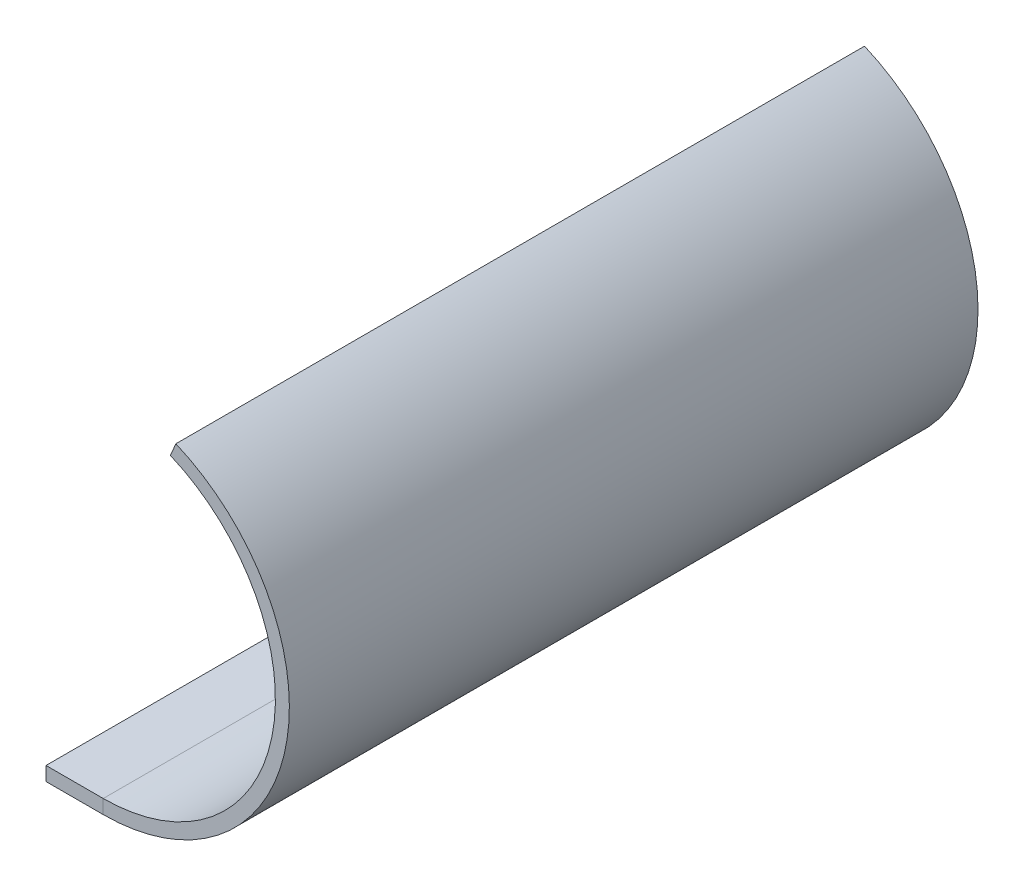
ISO-10303-21;
HEADER;
FILE_DESCRIPTION(('STEP AP214'),'2;1');
FILE_NAME('part.step','',(''),(''),'','','');
FILE_SCHEMA(('AUTOMOTIVE_DESIGN { 1 0 10303 214 1 1 1 1 }'));
ENDSEC;
DATA;
#1=APPLICATION_CONTEXT('core data for automotive mechanical design processes');
#2=APPLICATION_PROTOCOL_DEFINITION('international standard','automotive_design',2000,#1);
#3=PRODUCT_CONTEXT('',#1,'mechanical');
#4=PRODUCT('Part','Part','',(#3));
#5=PRODUCT_RELATED_PRODUCT_CATEGORY('part','',(#4));
#6=PRODUCT_DEFINITION_FORMATION('','',#4);
#7=PRODUCT_DEFINITION_CONTEXT('part definition',#1,'design');
#8=PRODUCT_DEFINITION('design','',#6,#7);
#9=PRODUCT_DEFINITION_SHAPE('','',#8);
#10=(LENGTH_UNIT() NAMED_UNIT(*) SI_UNIT(.MILLI.,.METRE.));
#11=(NAMED_UNIT(*) PLANE_ANGLE_UNIT() SI_UNIT($,.RADIAN.));
#12=(NAMED_UNIT(*) SI_UNIT($,.STERADIAN.) SOLID_ANGLE_UNIT());
#13=UNCERTAINTY_MEASURE_WITH_UNIT(LENGTH_MEASURE(1.E-05),#10,'distance_accuracy_value','');
#14=(GEOMETRIC_REPRESENTATION_CONTEXT(3) GLOBAL_UNCERTAINTY_ASSIGNED_CONTEXT((#13)) GLOBAL_UNIT_ASSIGNED_CONTEXT((#10,
#11,#12)) REPRESENTATION_CONTEXT('',''));
#15=CARTESIAN_POINT('',(0.,0.,0.));
#16=DIRECTION('',(0.,0.,1.));
#17=DIRECTION('',(1.,0.,0.));
#18=AXIS2_PLACEMENT_3D('',#15,#16,#17);
#19=CARTESIAN_POINT('',(0.,-40.,148.));
#20=DIRECTION('',(0.,0.,1.));
#21=DIRECTION('',(1.,0.,0.));
#22=AXIS2_PLACEMENT_3D('',#19,#20,#21);
#23=PLANE('',#22);
#24=DIRECTION('',(0.,1.,0.));
#25=VECTOR('',#24,1.);
#26=CARTESIAN_POINT('',(0.,-40.,148.));
#27=LINE('',#26,#25);
#28=CARTESIAN_POINT('',(0.,-40.,148.));
#29=VERTEX_POINT('',#28);
#30=CARTESIAN_POINT('',(0.,-37.,148.));
#31=VERTEX_POINT('',#30);
#32=EDGE_CURVE('E11',#29,#31,#27,.T.);
#33=ORIENTED_EDGE('',*,*,#32,.F.);
#34=CARTESIAN_POINT('',(0.,0.,148.));
#35=DIRECTION('',(0.,0.,1.));
#36=DIRECTION('',(1.,0.,0.));
#37=AXIS2_PLACEMENT_3D('',#34,#35,#36);
#38=CIRCLE('',#37,40.);
#39=CARTESIAN_POINT('',(15.6102695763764,36.8282430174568,148.));
#40=VERTEX_POINT('',#39);
#41=EDGE_CURVE('E87',#29,#40,#38,.T.);
#42=ORIENTED_EDGE('',*,*,#41,.T.);
#43=DIRECTION('',(0.39025673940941,0.92070607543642,0.));
#44=VECTOR('',#43,1.);
#45=CARTESIAN_POINT('',(14.4394993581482,34.0661247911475,148.));
#46=LINE('',#45,#44);
#47=CARTESIAN_POINT('',(14.4394993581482,34.0661247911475,148.));
#48=VERTEX_POINT('',#47);
#49=EDGE_CURVE('E148',#48,#40,#46,.T.);
#50=ORIENTED_EDGE('',*,*,#49,.F.);
#51=CARTESIAN_POINT('',(0.,0.,148.));
#52=DIRECTION('',(0.,0.,1.));
#53=DIRECTION('',(1.,0.,0.));
#54=AXIS2_PLACEMENT_3D('',#51,#52,#53);
#55=CIRCLE('',#54,37.);
#56=EDGE_CURVE('E114',#31,#48,#55,.T.);
#57=ORIENTED_EDGE('',*,*,#56,.F.);
#58=EDGE_LOOP('',(#33,#42,#50,#57));
#59=FACE_BOUND('',#58,.T.);
#60=ADVANCED_FACE('F40',(#59),#23,.T.);
#61=CARTESIAN_POINT('',(0.,-37.,0.));
#62=DIRECTION('',(0.,0.,-1.));
#63=DIRECTION('',(-1.,0.,0.));
#64=AXIS2_PLACEMENT_3D('',#61,#62,#63);
#65=PLANE('',#64);
#66=DIRECTION('',(0.,-1.,0.));
#67=VECTOR('',#66,1.);
#68=CARTESIAN_POINT('',(0.,-37.,0.));
#69=LINE('',#68,#67);
#70=CARTESIAN_POINT('',(0.,-37.,0.));
#71=VERTEX_POINT('',#70);
#72=CARTESIAN_POINT('',(0.,-40.,0.));
#73=VERTEX_POINT('',#72);
#74=EDGE_CURVE('E48',#71,#73,#69,.T.);
#75=ORIENTED_EDGE('',*,*,#74,.F.);
#76=CARTESIAN_POINT('',(0.,0.,0.));
#77=DIRECTION('',(0.,0.,1.));
#78=DIRECTION('',(1.,0.,0.));
#79=AXIS2_PLACEMENT_3D('',#76,#77,#78);
#80=CIRCLE('',#79,37.);
#81=CARTESIAN_POINT('',(14.4394993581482,34.0661247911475,0.));
#82=VERTEX_POINT('',#81);
#83=EDGE_CURVE('E129',#71,#82,#80,.T.);
#84=ORIENTED_EDGE('',*,*,#83,.T.);
#85=DIRECTION('',(0.39025673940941,0.92070607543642,0.));
#86=VECTOR('',#85,1.);
#87=CARTESIAN_POINT('',(14.4394993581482,34.0661247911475,0.));
#88=LINE('',#87,#86);
#89=CARTESIAN_POINT('',(15.6102695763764,36.8282430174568,0.));
#90=VERTEX_POINT('',#89);
#91=EDGE_CURVE('E126',#82,#90,#88,.T.);
#92=ORIENTED_EDGE('',*,*,#91,.T.);
#93=CARTESIAN_POINT('',(0.,0.,0.));
#94=DIRECTION('',(0.,0.,1.));
#95=DIRECTION('',(1.,0.,0.));
#96=AXIS2_PLACEMENT_3D('',#93,#94,#95);
#97=CIRCLE('',#96,40.);
#98=EDGE_CURVE('E123',#73,#90,#97,.T.);
#99=ORIENTED_EDGE('',*,*,#98,.F.);
#100=EDGE_LOOP('',(#75,#84,#92,#99));
#101=FACE_BOUND('',#100,.T.);
#102=ADVANCED_FACE('F154',(#101),#65,.T.);
#103=CARTESIAN_POINT('',(0.,0.,148.));
#104=DIRECTION('',(0.,0.,-1.));
#105=DIRECTION('',(-1.,0.,0.));
#106=AXIS2_PLACEMENT_3D('',#103,#104,#105);
#107=CYLINDRICAL_SURFACE('',#106,40.);
#108=ORIENTED_EDGE('',*,*,#98,.T.);
#109=DIRECTION('',(0.,0.,-1.));
#110=VECTOR('',#109,1.);
#111=CARTESIAN_POINT('',(15.6102695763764,36.8282430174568,148.));
#112=LINE('',#111,#110);
#113=EDGE_CURVE('E143',#40,#90,#112,.T.);
#114=ORIENTED_EDGE('',*,*,#113,.F.);
#115=ORIENTED_EDGE('',*,*,#41,.F.);
#116=DIRECTION('',(0.,0.,-1.));
#117=VECTOR('',#116,1.);
#118=CARTESIAN_POINT('',(0.,-40.,148.));
#119=LINE('',#118,#117);
#120=EDGE_CURVE('E119',#29,#73,#119,.T.);
#121=ORIENTED_EDGE('',*,*,#120,.T.);
#122=EDGE_LOOP('',(#108,#114,#115,#121));
#123=FACE_BOUND('',#122,.T.);
#124=ADVANCED_FACE('F151',(#123),#107,.T.);
#125=CARTESIAN_POINT('',(14.4394993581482,34.0661247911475,148.));
#126=DIRECTION('',(-0.92070607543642,0.39025673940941,0.));
#127=DIRECTION('',(-0.39025673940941,-0.920706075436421,0.));
#128=AXIS2_PLACEMENT_3D('',#125,#126,#127);
#129=PLANE('',#128);
#130=ORIENTED_EDGE('',*,*,#91,.F.);
#131=DIRECTION('',(0.,0.,-1.));
#132=VECTOR('',#131,1.);
#133=CARTESIAN_POINT('',(14.4394993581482,34.0661247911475,148.));
#134=LINE('',#133,#132);
#135=EDGE_CURVE('E141',#48,#82,#134,.T.);
#136=ORIENTED_EDGE('',*,*,#135,.F.);
#137=ORIENTED_EDGE('',*,*,#49,.T.);
#138=ORIENTED_EDGE('',*,*,#113,.T.);
#139=EDGE_LOOP('',(#130,#136,#137,#138));
#140=FACE_BOUND('',#139,.T.);
#141=ADVANCED_FACE('F147',(#140),#129,.T.);
#142=CARTESIAN_POINT('',(0.,0.,148.));
#143=DIRECTION('',(0.,0.,-1.));
#144=DIRECTION('',(-1.,0.,0.));
#145=AXIS2_PLACEMENT_3D('',#142,#143,#144);
#146=CYLINDRICAL_SURFACE('',#145,37.);
#147=ORIENTED_EDGE('',*,*,#83,.F.);
#148=DIRECTION('',(0.,0.,-1.));
#149=VECTOR('',#148,1.);
#150=CARTESIAN_POINT('',(0.,-37.,148.));
#151=LINE('',#150,#149);
#152=EDGE_CURVE('E107',#31,#71,#151,.T.);
#153=ORIENTED_EDGE('',*,*,#152,.F.);
#154=ORIENTED_EDGE('',*,*,#56,.T.);
#155=ORIENTED_EDGE('',*,*,#135,.T.);
#156=EDGE_LOOP('',(#147,#153,#154,#155));
#157=FACE_BOUND('',#156,.T.);
#158=ADVANCED_FACE('F157',(#157),#146,.F.);
#159=CARTESIAN_POINT('',(-12.3,-37.,148.));
#160=DIRECTION('',(0.,1.,0.));
#161=DIRECTION('',(0.,0.,1.));
#162=AXIS2_PLACEMENT_3D('',#159,#160,#161);
#163=PLANE('',#162);
#164=DIRECTION('',(1.,0.,0.));
#165=VECTOR('',#164,1.);
#166=CARTESIAN_POINT('',(-12.3,-37.,0.));
#167=LINE('',#166,#165);
#168=CARTESIAN_POINT('',(-12.3,-37.,0.));
#169=VERTEX_POINT('',#168);
#170=EDGE_CURVE('E102',#169,#71,#167,.T.);
#171=ORIENTED_EDGE('',*,*,#170,.F.);
#172=DIRECTION('',(0.,0.,-1.));
#173=VECTOR('',#172,1.);
#174=CARTESIAN_POINT('',(-12.3,-37.,148.));
#175=LINE('',#174,#173);
#176=CARTESIAN_POINT('',(-12.3,-37.,148.));
#177=VERTEX_POINT('',#176);
#178=EDGE_CURVE('E97',#177,#169,#175,.T.);
#179=ORIENTED_EDGE('',*,*,#178,.F.);
#180=DIRECTION('',(1.,0.,0.));
#181=VECTOR('',#180,1.);
#182=CARTESIAN_POINT('',(-12.3,-37.,148.));
#183=LINE('',#182,#181);
#184=EDGE_CURVE('E101',#177,#31,#183,.T.);
#185=ORIENTED_EDGE('',*,*,#184,.T.);
#186=ORIENTED_EDGE('',*,*,#152,.T.);
#187=EDGE_LOOP('',(#171,#179,#185,#186));
#188=FACE_BOUND('',#187,.T.);
#189=ADVANCED_FACE('F99',(#188),#163,.T.);
#190=CARTESIAN_POINT('',(-12.3,-40.,148.));
#191=DIRECTION('',(-1.,0.,0.));
#192=DIRECTION('',(0.,0.,1.));
#193=AXIS2_PLACEMENT_3D('',#190,#191,#192);
#194=PLANE('',#193);
#195=DIRECTION('',(0.,1.,0.));
#196=VECTOR('',#195,1.);
#197=CARTESIAN_POINT('',(-12.3,-40.,0.));
#198=LINE('',#197,#196);
#199=CARTESIAN_POINT('',(-12.3,-40.,0.));
#200=VERTEX_POINT('',#199);
#201=EDGE_CURVE('E133',#200,#169,#198,.T.);
#202=ORIENTED_EDGE('',*,*,#201,.F.);
#203=DIRECTION('',(0.,0.,-1.));
#204=VECTOR('',#203,1.);
#205=CARTESIAN_POINT('',(-12.3,-40.,148.));
#206=LINE('',#205,#204);
#207=CARTESIAN_POINT('',(-12.3,-40.,148.));
#208=VERTEX_POINT('',#207);
#209=EDGE_CURVE('E77',#208,#200,#206,.T.);
#210=ORIENTED_EDGE('',*,*,#209,.F.);
#211=DIRECTION('',(0.,1.,0.));
#212=VECTOR('',#211,1.);
#213=CARTESIAN_POINT('',(-12.3,-40.,148.));
#214=LINE('',#213,#212);
#215=EDGE_CURVE('E112',#208,#177,#214,.T.);
#216=ORIENTED_EDGE('',*,*,#215,.T.);
#217=ORIENTED_EDGE('',*,*,#178,.T.);
#218=EDGE_LOOP('',(#202,#210,#216,#217));
#219=FACE_BOUND('',#218,.T.);
#220=ADVANCED_FACE('F116',(#219),#194,.T.);
#221=CARTESIAN_POINT('',(-12.3,-40.,148.));
#222=DIRECTION('',(0.,1.,0.));
#223=DIRECTION('',(0.,0.,1.));
#224=AXIS2_PLACEMENT_3D('',#221,#222,#223);
#225=PLANE('',#224);
#226=DIRECTION('',(1.,0.,0.));
#227=VECTOR('',#226,1.);
#228=CARTESIAN_POINT('',(-12.3,-40.,0.));
#229=LINE('',#228,#227);
#230=EDGE_CURVE('E135',#200,#73,#229,.T.);
#231=ORIENTED_EDGE('',*,*,#230,.T.);
#232=ORIENTED_EDGE('',*,*,#120,.F.);
#233=DIRECTION('',(1.,0.,0.));
#234=VECTOR('',#233,1.);
#235=CARTESIAN_POINT('',(-12.3,-40.,148.));
#236=LINE('',#235,#234);
#237=EDGE_CURVE('E117',#208,#29,#236,.T.);
#238=ORIENTED_EDGE('',*,*,#237,.F.);
#239=ORIENTED_EDGE('',*,*,#209,.T.);
#240=EDGE_LOOP('',(#231,#232,#238,#239));
#241=FACE_BOUND('',#240,.T.);
#242=ADVANCED_FACE('F160',(#241),#225,.F.);
#243=CARTESIAN_POINT('',(0.,0.,148.));
#244=DIRECTION('',(0.,0.,1.));
#245=DIRECTION('',(1.,0.,0.));
#246=AXIS2_PLACEMENT_3D('',#243,#244,#245);
#247=PLANE('',#246);
#248=ORIENTED_EDGE('',*,*,#237,.T.);
#249=ORIENTED_EDGE('',*,*,#32,.T.);
#250=ORIENTED_EDGE('',*,*,#184,.F.);
#251=ORIENTED_EDGE('',*,*,#215,.F.);
#252=EDGE_LOOP('',(#248,#249,#250,#251));
#253=FACE_BOUND('',#252,.T.);
#254=ADVANCED_FACE('F111',(#253),#247,.T.);
#255=CARTESIAN_POINT('',(0.,0.,0.));
#256=DIRECTION('',(0.,0.,1.));
#257=DIRECTION('',(1.,0.,0.));
#258=AXIS2_PLACEMENT_3D('',#255,#256,#257);
#259=PLANE('',#258);
#260=ORIENTED_EDGE('',*,*,#170,.T.);
#261=ORIENTED_EDGE('',*,*,#74,.T.);
#262=ORIENTED_EDGE('',*,*,#230,.F.);
#263=ORIENTED_EDGE('',*,*,#201,.T.);
#264=EDGE_LOOP('',(#260,#261,#262,#263));
#265=FACE_BOUND('',#264,.T.);
#266=ADVANCED_FACE('F159',(#265),#259,.F.);
#267=CLOSED_SHELL('',(#60,#102,#124,#141,#158,#189,#220,#242,#254,#266));
#268=MANIFOLD_SOLID_BREP('B2',#267);
#269=ADVANCED_BREP_SHAPE_REPRESENTATION('',(#18,#268),#14);
#270=SHAPE_DEFINITION_REPRESENTATION(#9,#269);
ENDSEC;
END-ISO-10303-21;
